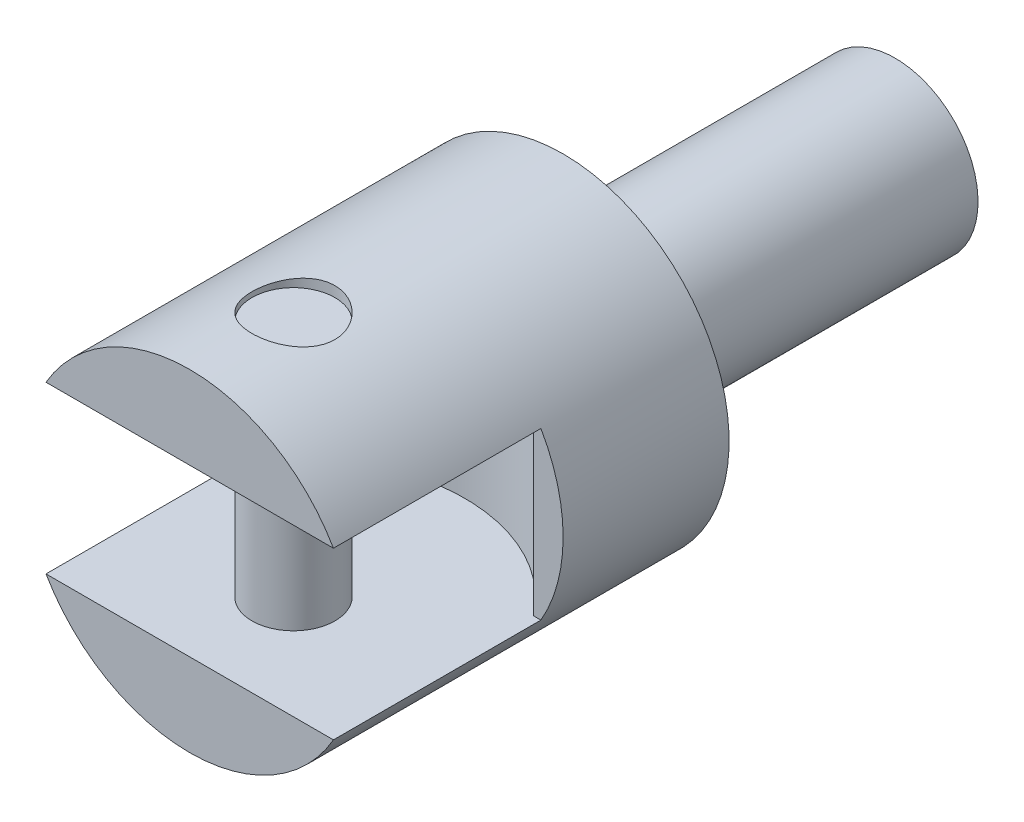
ISO-10303-21;
HEADER;
FILE_DESCRIPTION(('STEP AP214'),'2;1');
FILE_NAME('part.step','',(''),(''),'','','');
FILE_SCHEMA(('AUTOMOTIVE_DESIGN { 1 0 10303 214 1 1 1 1 }'));
ENDSEC;
DATA;
#1=APPLICATION_CONTEXT('core data for automotive mechanical design processes');
#2=APPLICATION_PROTOCOL_DEFINITION('international standard','automotive_design',2000,#1);
#3=PRODUCT_CONTEXT('',#1,'mechanical');
#4=PRODUCT('Part','Part','',(#3));
#5=PRODUCT_RELATED_PRODUCT_CATEGORY('part','',(#4));
#6=PRODUCT_DEFINITION_FORMATION('','',#4);
#7=PRODUCT_DEFINITION_CONTEXT('part definition',#1,'design');
#8=PRODUCT_DEFINITION('design','',#6,#7);
#9=PRODUCT_DEFINITION_SHAPE('','',#8);
#10=(LENGTH_UNIT() NAMED_UNIT(*) SI_UNIT(.MILLI.,.METRE.));
#11=(NAMED_UNIT(*) PLANE_ANGLE_UNIT() SI_UNIT($,.RADIAN.));
#12=(NAMED_UNIT(*) SI_UNIT($,.STERADIAN.) SOLID_ANGLE_UNIT());
#13=UNCERTAINTY_MEASURE_WITH_UNIT(LENGTH_MEASURE(1.E-05),#10,'distance_accuracy_value','');
#14=(GEOMETRIC_REPRESENTATION_CONTEXT(3) GLOBAL_UNCERTAINTY_ASSIGNED_CONTEXT((#13)) GLOBAL_UNIT_ASSIGNED_CONTEXT((#10,
#11,#12)) REPRESENTATION_CONTEXT('',''));
#15=CARTESIAN_POINT('',(0.,0.,0.));
#16=DIRECTION('',(0.,0.,1.));
#17=DIRECTION('',(1.,0.,0.));
#18=AXIS2_PLACEMENT_3D('',#15,#16,#17);
#19=CARTESIAN_POINT('',(0.,-14.,13.));
#20=DIRECTION('',(0.,1.,0.));
#21=DIRECTION('',(-1.,0.,0.));
#22=AXIS2_PLACEMENT_3D('',#19,#20,#21);
#23=CYLINDRICAL_SURFACE('',#22,2.);
#24=CARTESIAN_POINT('',(0.,-8.,15.));
#25=CARTESIAN_POINT('',(-0.110501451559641,-7.99999813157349,14.9999968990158));
#26=CARTESIAN_POINT('',(-0.22103754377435,-7.99768770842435,14.9908112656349));
#27=CARTESIAN_POINT('',(-0.438941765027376,-7.98869485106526,14.954366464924));
#28=CARTESIAN_POINT('',(-0.546308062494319,-7.98200993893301,14.9270970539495));
#29=CARTESIAN_POINT('',(-0.754694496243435,-7.96500835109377,14.8554143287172));
#30=CARTESIAN_POINT('',(-0.855722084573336,-7.95469603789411,14.811021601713));
#31=CARTESIAN_POINT('',(-1.04889617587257,-7.93153791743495,14.7064248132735));
#32=CARTESIAN_POINT('',(-1.14104237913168,-7.91869202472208,14.646220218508));
#33=CARTESIAN_POINT('',(-1.31573590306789,-7.89156551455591,14.5103989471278));
#34=CARTESIAN_POINT('',(-1.39807425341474,-7.87726276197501,14.4345179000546));
#35=CARTESIAN_POINT('',(-1.54899856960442,-7.84898160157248,14.270063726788));
#36=CARTESIAN_POINT('',(-1.61758298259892,-7.83500323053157,14.1814891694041));
#37=CARTESIAN_POINT('',(-1.74003539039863,-7.80873034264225,13.992539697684));
#38=CARTESIAN_POINT('',(-1.79366962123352,-7.79646392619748,13.8920090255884));
#39=CARTESIAN_POINT('',(-1.88319587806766,-7.77532659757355,13.6830021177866));
#40=CARTESIAN_POINT('',(-1.91909074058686,-7.76645514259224,13.5745271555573));
#41=CARTESIAN_POINT('',(-1.97140644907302,-7.7533396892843,13.3550086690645));
#42=CARTESIAN_POINT('',(-1.98820302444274,-7.74900654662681,13.244060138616));
#43=CARTESIAN_POINT('',(-2.00301570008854,-7.74519149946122,13.0208419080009));
#44=CARTESIAN_POINT('',(-2.00103485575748,-7.74570880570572,12.9085724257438));
#45=CARTESIAN_POINT('',(-1.9786486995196,-7.75145607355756,12.6887789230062));
#46=CARTESIAN_POINT('',(-1.95869112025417,-7.75657150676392,12.5812058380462));
#47=CARTESIAN_POINT('',(-1.90163224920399,-7.77075612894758,12.3709852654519));
#48=CARTESIAN_POINT('',(-1.86452973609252,-7.77982559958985,12.2683381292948));
#49=CARTESIAN_POINT('',(-1.77385263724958,-7.80100151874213,12.0696826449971));
#50=CARTESIAN_POINT('',(-1.72011555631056,-7.81313769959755,11.9737517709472));
#51=CARTESIAN_POINT('',(-1.59780836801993,-7.83906281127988,11.7921083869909));
#52=CARTESIAN_POINT('',(-1.52923566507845,-7.85285203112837,11.7063976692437));
#53=CARTESIAN_POINT('',(-1.37688456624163,-7.88101174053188,11.5450618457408));
#54=CARTESIAN_POINT('',(-1.29272834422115,-7.89538759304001,11.4697940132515));
#55=CARTESIAN_POINT('',(-1.11281589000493,-7.92274620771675,11.3343716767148));
#56=CARTESIAN_POINT('',(-1.01705930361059,-7.93572892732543,11.2742176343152));
#57=CARTESIAN_POINT('',(-0.816154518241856,-7.9589030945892,11.1705992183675));
#58=CARTESIAN_POINT('',(-0.710975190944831,-7.96908480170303,11.1271928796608));
#59=CARTESIAN_POINT('',(-0.49450134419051,-7.98543889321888,11.0587769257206));
#60=CARTESIAN_POINT('',(-0.383207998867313,-7.99161204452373,11.0337637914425));
#61=CARTESIAN_POINT('',(-0.160719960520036,-7.999139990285,11.0033899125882));
#62=CARTESIAN_POINT('',(-0.0495956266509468,-8.00061404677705,10.9975426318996));
#63=CARTESIAN_POINT('',(0.172043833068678,-7.99891739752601,11.0043320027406));
#64=CARTESIAN_POINT('',(0.282559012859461,-7.99574710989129,11.0169669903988));
#65=CARTESIAN_POINT('',(0.498152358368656,-7.98519441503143,11.0599612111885));
#66=CARTESIAN_POINT('',(0.603286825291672,-7.97787512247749,11.0900550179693));
#67=CARTESIAN_POINT('',(0.807009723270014,-7.95984942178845,11.1668094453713));
#68=CARTESIAN_POINT('',(0.905597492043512,-7.94914267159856,11.2134717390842));
#69=CARTESIAN_POINT('',(1.0953641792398,-7.92524410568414,11.3229815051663));
#70=CARTESIAN_POINT('',(1.18638058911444,-7.91201156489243,11.3861014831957));
#71=CARTESIAN_POINT('',(1.35670215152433,-7.88459345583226,11.5263865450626));
#72=CARTESIAN_POINT('',(1.43600527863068,-7.87040772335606,11.6035540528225));
#73=CARTESIAN_POINT('',(1.58265409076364,-7.84225275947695,11.7720026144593));
#74=CARTESIAN_POINT('',(1.64965849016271,-7.82829738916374,11.8635836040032));
#75=CARTESIAN_POINT('',(1.76734767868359,-7.80257171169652,12.0569768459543));
#76=CARTESIAN_POINT('',(1.81803319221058,-7.79080130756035,12.1587886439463));
#77=CARTESIAN_POINT('',(1.90126856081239,-7.77090792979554,12.3692076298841));
#78=CARTESIAN_POINT('',(1.93392586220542,-7.76276340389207,12.4777701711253));
#79=CARTESIAN_POINT('',(1.98046087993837,-7.75102325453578,12.6990795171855));
#80=CARTESIAN_POINT('',(1.99434270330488,-7.74742663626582,12.8118254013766));
#81=CARTESIAN_POINT('',(2.00271812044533,-7.74526534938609,13.0348280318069));
#82=CARTESIAN_POINT('',(1.99775719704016,-7.74655910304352,13.145063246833));
#83=CARTESIAN_POINT('',(1.96983637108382,-7.7537054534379,13.3630718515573));
#84=CARTESIAN_POINT('',(1.94687683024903,-7.75955795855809,13.4708452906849));
#85=CARTESIAN_POINT('',(1.88390842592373,-7.77508347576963,13.6802779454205));
#86=CARTESIAN_POINT('',(1.84400187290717,-7.78473353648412,13.7819697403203));
#87=CARTESIAN_POINT('',(1.74835321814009,-7.80677007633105,13.9772871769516));
#88=CARTESIAN_POINT('',(1.69260892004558,-7.81915693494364,14.0709116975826));
#89=CARTESIAN_POINT('',(1.56515699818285,-7.8456751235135,14.2500728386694));
#90=CARTESIAN_POINT('',(1.49307088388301,-7.85984353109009,14.3353347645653));
#91=CARTESIAN_POINT('',(1.33571916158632,-7.88810702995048,14.4927293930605));
#92=CARTESIAN_POINT('',(1.25045042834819,-7.90220210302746,14.5648589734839));
#93=CARTESIAN_POINT('',(1.06729011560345,-7.9290354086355,14.6952150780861));
#94=CARTESIAN_POINT('',(0.969197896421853,-7.94174444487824,14.7531661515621));
#95=CARTESIAN_POINT('',(0.764354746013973,-7.96406566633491,14.8516632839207));
#96=CARTESIAN_POINT('',(0.65761008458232,-7.97368006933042,14.892221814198));
#97=CARTESIAN_POINT('',(0.459213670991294,-7.98730746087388,14.9487624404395));
#98=CARTESIAN_POINT('',(0.368506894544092,-7.9920344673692,14.9679349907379));
#99=CARTESIAN_POINT('',(0.185208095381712,-7.99838140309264,14.9935545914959));
#100=CARTESIAN_POINT('',(0.0926162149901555,-8.00000156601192,15.0000025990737));
#101=CARTESIAN_POINT('',(0.,-8.,15.));
#102=B_SPLINE_CURVE_WITH_KNOTS('',3,(#24,#25,#26,#27,#28,#29,#30,#31,#32,#33,#34,#35,#36,#37,
#38,#39,#40,#41,#42,#43,#44,#45,#46,#47,#48,#49,#50,#51,#52,#53,#54,#55,#56,#57,#58,#59,#60,#61,
#62,#63,#64,#65,#66,#67,#68,#69,#70,#71,#72,#73,#74,#75,#76,#77,#78,#79,#80,#81,#82,#83,#84,#85,
#86,#87,#88,#89,#90,#91,#92,#93,#94,#95,#96,#97,#98,#99,#100,#101),.UNSPECIFIED.,.T.,.F.,(4,2,2,
2,2,2,2,2,2,2,2,2,2,2,2,2,2,2,2,2,2,2,2,2,2,2,2,2,2,2,2,2,2,2,2,2,2,2,4),(0.,0.331164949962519,
0.662517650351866,0.993473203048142,1.32443992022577,1.66152580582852,1.99864972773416,
2.34078196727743,2.68285948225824,3.01808393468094,3.35325384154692,3.68029996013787,
4.00736937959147,4.337740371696,4.66816921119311,5.00802001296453,5.34788119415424,
5.6889097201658,6.02987298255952,6.36211078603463,6.69431868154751,7.02160366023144,
7.34892169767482,7.68204783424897,8.01523150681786,8.35659345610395,8.69794025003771,
9.03723006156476,9.37644564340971,9.70591707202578,10.0353818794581,10.3628853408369,
10.6904342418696,11.0265276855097,11.3627009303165,11.7049624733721,12.0469781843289,
12.3245632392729,12.6021274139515),.UNSPECIFIED.);
#103=CARTESIAN_POINT('',(0.,-8.,15.));
#104=VERTEX_POINT('',#103);
#105=EDGE_CURVE('E110',#104,#104,#102,.T.);
#106=ORIENTED_EDGE('',*,*,#105,.T.);
#107=EDGE_LOOP('',(#106));
#108=FACE_BOUND('',#107,.T.);
#109=CARTESIAN_POINT('',(0.,-7.5,13.));
#110=DIRECTION('',(0.,1.,0.));
#111=DIRECTION('',(0.,0.,1.));
#112=AXIS2_PLACEMENT_3D('',#109,#110,#111);
#113=CIRCLE('',#112,2.);
#114=CARTESIAN_POINT('',(0.,-7.5,15.));
#115=VERTEX_POINT('',#114);
#116=EDGE_CURVE('E9',#115,#115,#113,.F.);
#117=ORIENTED_EDGE('',*,*,#116,.F.);
#118=EDGE_LOOP('',(#117));
#119=FACE_BOUND('',#118,.T.);
#120=ADVANCED_FACE('F14',(#108,#119),#23,.F.);
#121=CARTESIAN_POINT('',(-3.25,0.,0.));
#122=DIRECTION('',(0.,0.,-1.));
#123=DIRECTION('',(0.,-1.,0.));
#124=AXIS2_PLACEMENT_3D('',#121,#122,#123);
#125=PLANE('',#124);
#126=CARTESIAN_POINT('',(0.,0.,0.));
#127=DIRECTION('',(0.,0.,-1.));
#128=DIRECTION('',(0.,-1.,0.));
#129=AXIS2_PLACEMENT_3D('',#126,#127,#128);
#130=CIRCLE('',#129,3.25);
#131=CARTESIAN_POINT('',(0.,-3.25,0.));
#132=VERTEX_POINT('',#131);
#133=EDGE_CURVE('E170',#132,#132,#130,.T.);
#134=ORIENTED_EDGE('',*,*,#133,.F.);
#135=EDGE_LOOP('',(#134));
#136=FACE_BOUND('',#135,.T.);
#137=CARTESIAN_POINT('',(0.,0.,0.));
#138=DIRECTION('',(0.,0.,-1.));
#139=DIRECTION('',(0.,-1.,0.));
#140=AXIS2_PLACEMENT_3D('',#137,#138,#139);
#141=CIRCLE('',#140,8.);
#142=CARTESIAN_POINT('',(0.,-8.,0.));
#143=VERTEX_POINT('',#142);
#144=EDGE_CURVE('E91',#143,#143,#141,.T.);
#145=ORIENTED_EDGE('',*,*,#144,.T.);
#146=EDGE_LOOP('',(#145));
#147=FACE_BOUND('',#146,.T.);
#148=ADVANCED_FACE('F119',(#136,#147),#125,.T.);
#149=CARTESIAN_POINT('',(0.,0.,0.));
#150=DIRECTION('',(0.,0.,-1.));
#151=DIRECTION('',(0.,-1.,0.));
#152=AXIS2_PLACEMENT_3D('',#149,#150,#151);
#153=CYLINDRICAL_SURFACE('',#152,3.25);
#154=ORIENTED_EDGE('',*,*,#133,.T.);
#155=EDGE_LOOP('',(#154));
#156=FACE_BOUND('',#155,.T.);
#157=CARTESIAN_POINT('',(0.,0.,-2.));
#158=DIRECTION('',(0.,0.,-1.));
#159=DIRECTION('',(0.,-1.,0.));
#160=AXIS2_PLACEMENT_3D('',#157,#158,#159);
#161=CIRCLE('',#160,3.25);
#162=CARTESIAN_POINT('',(0.,-3.25,-2.));
#163=VERTEX_POINT('',#162);
#164=EDGE_CURVE('E336',#163,#163,#161,.T.);
#165=ORIENTED_EDGE('',*,*,#164,.F.);
#166=EDGE_LOOP('',(#165));
#167=FACE_BOUND('',#166,.T.);
#168=ADVANCED_FACE('F157',(#156,#167),#153,.T.);
#169=CARTESIAN_POINT('',(-4.,0.,-2.));
#170=DIRECTION('',(0.,0.,1.));
#171=DIRECTION('',(0.,1.,0.));
#172=AXIS2_PLACEMENT_3D('',#169,#170,#171);
#173=PLANE('',#172);
#174=ORIENTED_EDGE('',*,*,#164,.T.);
#175=EDGE_LOOP('',(#174));
#176=FACE_BOUND('',#175,.T.);
#177=CARTESIAN_POINT('',(0.,0.,-2.));
#178=DIRECTION('',(0.,0.,-1.));
#179=DIRECTION('',(0.,-1.,0.));
#180=AXIS2_PLACEMENT_3D('',#177,#178,#179);
#181=CIRCLE('',#180,4.);
#182=CARTESIAN_POINT('',(0.,-4.,-2.));
#183=VERTEX_POINT('',#182);
#184=EDGE_CURVE('E333',#183,#183,#181,.T.);
#185=ORIENTED_EDGE('',*,*,#184,.F.);
#186=EDGE_LOOP('',(#185));
#187=FACE_BOUND('',#186,.T.);
#188=ADVANCED_FACE('F153',(#176,#187),#173,.T.);
#189=CARTESIAN_POINT('',(0.,0.,0.));
#190=DIRECTION('',(0.,0.,-1.));
#191=DIRECTION('',(0.,-1.,0.));
#192=AXIS2_PLACEMENT_3D('',#189,#190,#191);
#193=CYLINDRICAL_SURFACE('',#192,4.);
#194=ORIENTED_EDGE('',*,*,#184,.T.);
#195=EDGE_LOOP('',(#194));
#196=FACE_BOUND('',#195,.T.);
#197=CARTESIAN_POINT('',(0.,0.,-16.));
#198=DIRECTION('',(0.,0.,-1.));
#199=DIRECTION('',(0.,-1.,0.));
#200=AXIS2_PLACEMENT_3D('',#197,#198,#199);
#201=CIRCLE('',#200,4.);
#202=CARTESIAN_POINT('',(0.,-4.,-16.));
#203=VERTEX_POINT('',#202);
#204=EDGE_CURVE('E84',#203,#203,#201,.T.);
#205=ORIENTED_EDGE('',*,*,#204,.F.);
#206=EDGE_LOOP('',(#205));
#207=FACE_BOUND('',#206,.T.);
#208=ADVANCED_FACE('F149',(#196,#207),#193,.T.);
#209=CARTESIAN_POINT('',(0.,0.,-16.));
#210=DIRECTION('',(0.,0.,-1.));
#211=DIRECTION('',(0.,-1.,0.));
#212=AXIS2_PLACEMENT_3D('',#209,#210,#211);
#213=PLANE('',#212);
#214=ORIENTED_EDGE('',*,*,#204,.T.);
#215=EDGE_LOOP('',(#214));
#216=FACE_BOUND('',#215,.T.);
#217=ADVANCED_FACE('F145',(#216),#213,.T.);
#218=CARTESIAN_POINT('',(0.,0.,18.));
#219=DIRECTION('',(0.,0.,1.));
#220=DIRECTION('',(0.,1.,0.));
#221=AXIS2_PLACEMENT_3D('',#218,#219,#220);
#222=PLANE('',#221);
#223=DIRECTION('',(1.,0.,0.));
#224=VECTOR('',#223,1.);
#225=CARTESIAN_POINT('',(-8.,4.,18.));
#226=LINE('',#225,#224);
#227=CARTESIAN_POINT('',(-6.92820323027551,4.,18.));
#228=VERTEX_POINT('',#227);
#229=CARTESIAN_POINT('',(6.92820323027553,4.,18.));
#230=VERTEX_POINT('',#229);
#231=EDGE_CURVE('E313',#228,#230,#226,.T.);
#232=ORIENTED_EDGE('',*,*,#231,.T.);
#233=CARTESIAN_POINT('',(0.,0.,18.));
#234=DIRECTION('',(0.,0.,1.));
#235=DIRECTION('',(0.,1.,0.));
#236=AXIS2_PLACEMENT_3D('',#233,#234,#235);
#237=CIRCLE('',#236,8.);
#238=EDGE_CURVE('E87',#230,#228,#237,.T.);
#239=ORIENTED_EDGE('',*,*,#238,.T.);
#240=EDGE_LOOP('',(#232,#239));
#241=FACE_BOUND('',#240,.T.);
#242=ADVANCED_FACE('F142',(#241),#222,.T.);
#243=DIRECTION('',(1.,0.,0.));
#244=VECTOR('',#243,1.);
#245=CARTESIAN_POINT('',(-8.,-4.,18.));
#246=LINE('',#245,#244);
#247=CARTESIAN_POINT('',(-6.92820323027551,-4.,18.));
#248=VERTEX_POINT('',#247);
#249=CARTESIAN_POINT('',(6.92820323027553,-4.,18.));
#250=VERTEX_POINT('',#249);
#251=EDGE_CURVE('E69',#248,#250,#246,.T.);
#252=ORIENTED_EDGE('',*,*,#251,.F.);
#253=CARTESIAN_POINT('',(0.,0.,18.));
#254=DIRECTION('',(0.,0.,1.));
#255=DIRECTION('',(0.,1.,0.));
#256=AXIS2_PLACEMENT_3D('',#253,#254,#255);
#257=CIRCLE('',#256,8.);
#258=EDGE_CURVE('E83',#248,#250,#257,.T.);
#259=ORIENTED_EDGE('',*,*,#258,.T.);
#260=EDGE_LOOP('',(#252,#259));
#261=FACE_BOUND('',#260,.T.);
#262=ADVANCED_FACE('F86',(#261),#222,.T.);
#263=CARTESIAN_POINT('',(0.,-4.,13.));
#264=DIRECTION('',(0.,1.,0.));
#265=DIRECTION('',(-1.,0.,0.));
#266=AXIS2_PLACEMENT_3D('',#263,#264,#265);
#267=CYLINDRICAL_SURFACE('',#266,8.25);
#268=CARTESIAN_POINT('',(0.,4.,13.));
#269=DIRECTION('',(0.,1.,0.));
#270=DIRECTION('',(-1.,0.,0.));
#271=AXIS2_PLACEMENT_3D('',#268,#269,#270);
#272=CIRCLE('',#271,8.25);
#273=CARTESIAN_POINT('',(6.56220237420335,4.,8.));
#274=VERTEX_POINT('',#273);
#275=CARTESIAN_POINT('',(-6.56220237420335,4.,8.));
#276=VERTEX_POINT('',#275);
#277=EDGE_CURVE('E307',#274,#276,#272,.T.);
#278=ORIENTED_EDGE('',*,*,#277,.T.);
#279=DIRECTION('',(0.,1.,0.));
#280=VECTOR('',#279,1.);
#281=CARTESIAN_POINT('',(-6.56220237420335,-4.,8.));
#282=LINE('',#281,#280);
#283=CARTESIAN_POINT('',(-6.56220237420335,-4.,8.));
#284=VERTEX_POINT('',#283);
#285=EDGE_CURVE('E324',#284,#276,#282,.T.);
#286=ORIENTED_EDGE('',*,*,#285,.F.);
#287=CARTESIAN_POINT('',(0.,-4.,13.));
#288=DIRECTION('',(0.,1.,0.));
#289=DIRECTION('',(-1.,0.,0.));
#290=AXIS2_PLACEMENT_3D('',#287,#288,#289);
#291=CIRCLE('',#290,8.25);
#292=CARTESIAN_POINT('',(6.56220237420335,-4.,8.));
#293=VERTEX_POINT('',#292);
#294=EDGE_CURVE('E320',#293,#284,#291,.T.);
#295=ORIENTED_EDGE('',*,*,#294,.F.);
#296=DIRECTION('',(0.,1.,0.));
#297=VECTOR('',#296,1.);
#298=CARTESIAN_POINT('',(6.56220237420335,-4.,8.));
#299=LINE('',#298,#297);
#300=EDGE_CURVE('E321',#293,#274,#299,.T.);
#301=ORIENTED_EDGE('',*,*,#300,.T.);
#302=EDGE_LOOP('',(#278,#286,#295,#301));
#303=FACE_BOUND('',#302,.T.);
#304=ADVANCED_FACE('F138',(#303),#267,.F.);
#305=CARTESIAN_POINT('',(0.,7.5,13.));
#306=DIRECTION('',(0.,1.,0.));
#307=DIRECTION('',(0.911552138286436,0.,-0.411184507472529));
#308=AXIS2_PLACEMENT_3D('',#305,#306,#307);
#309=CIRCLE('',#308,2.);
#310=CARTESIAN_POINT('',(1.82310427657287,7.5,12.1776309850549));
#311=VERTEX_POINT('',#310);
#312=EDGE_CURVE('E94',#311,#311,#309,.T.);
#313=ORIENTED_EDGE('',*,*,#312,.F.);
#314=EDGE_LOOP('',(#313));
#315=FACE_BOUND('',#314,.T.);
#316=CARTESIAN_POINT('',(-2.,7.74596669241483,13.));
#317=CARTESIAN_POINT('',(-1.99999686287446,7.74596880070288,13.1104406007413));
#318=CARTESIAN_POINT('',(-1.99082099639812,7.74835444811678,13.2209159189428));
#319=CARTESIAN_POINT('',(-1.95441850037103,7.75761489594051,13.4386940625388));
#320=CARTESIAN_POINT('',(-1.92718136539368,7.76449230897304,13.5459950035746));
#321=CARTESIAN_POINT('',(-1.85559295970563,7.7819097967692,13.7542428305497));
#322=CARTESIAN_POINT('',(-1.81126378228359,7.79244514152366,13.8551977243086));
#323=CARTESIAN_POINT('',(-1.70681691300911,7.81598553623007,14.0482486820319));
#324=CARTESIAN_POINT('',(-1.64669855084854,7.82899069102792,14.1403443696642));
#325=CARTESIAN_POINT('',(-1.5109667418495,7.856325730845,14.3150893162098));
#326=CARTESIAN_POINT('',(-1.43506951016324,7.87067678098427,14.39751488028));
#327=CARTESIAN_POINT('',(-1.27054565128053,7.89890300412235,14.5486091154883));
#328=CARTESIAN_POINT('',(-1.18191783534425,7.91277813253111,14.6172765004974));
#329=CARTESIAN_POINT('',(-0.992916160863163,7.93872332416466,14.739820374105));
#330=CARTESIAN_POINT('',(-0.892395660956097,7.95076549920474,14.7934771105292));
#331=CARTESIAN_POINT('',(-0.68341054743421,7.97144649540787,14.8830477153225));
#332=CARTESIAN_POINT('',(-0.574947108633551,7.98008581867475,14.9189642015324));
#333=CARTESIAN_POINT('',(-0.355487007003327,7.99283807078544,14.9713182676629));
#334=CARTESIAN_POINT('',(-0.244586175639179,7.99703915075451,14.9881357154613));
#335=CARTESIAN_POINT('',(-0.0214630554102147,8.00074875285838,15.0030067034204));
#336=CARTESIAN_POINT('',(0.0907590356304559,8.00025796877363,15.0010630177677));
#337=CARTESIAN_POINT('',(0.310704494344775,7.99470475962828,14.9787401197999));
#338=CARTESIAN_POINT('',(0.418472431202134,7.98974401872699,14.9587709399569));
#339=CARTESIAN_POINT('',(0.629076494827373,7.97592669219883,14.9016229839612));
#340=CARTESIAN_POINT('',(0.731912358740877,7.96706989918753,14.8644432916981));
#341=CARTESIAN_POINT('',(0.930813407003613,7.94630007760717,14.7735979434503));
#342=CARTESIAN_POINT('',(1.02680901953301,7.93436015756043,14.7197863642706));
#343=CARTESIAN_POINT('',(1.20855124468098,7.90871923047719,14.597315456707));
#344=CARTESIAN_POINT('',(1.29429607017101,7.89501791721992,14.5286535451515));
#345=CARTESIAN_POINT('',(1.45554807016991,7.86690971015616,14.3762330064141));
#346=CARTESIAN_POINT('',(1.5307153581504,7.85249375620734,14.2921160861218));
#347=CARTESIAN_POINT('',(1.66595275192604,7.82492034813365,14.1123200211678));
#348=CARTESIAN_POINT('',(1.72602215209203,7.81176295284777,14.0166403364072));
#349=CARTESIAN_POINT('',(1.82957625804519,7.78816397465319,13.8157679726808));
#350=CARTESIAN_POINT('',(1.87297913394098,7.77773586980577,13.7105314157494));
#351=CARTESIAN_POINT('',(1.94137124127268,7.76094912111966,13.4939316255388));
#352=CARTESIAN_POINT('',(1.96636441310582,7.75458960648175,13.3825697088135));
#353=CARTESIAN_POINT('',(1.99666371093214,7.74684284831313,13.1600323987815));
#354=CARTESIAN_POINT('',(2.0024723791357,7.74532871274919,13.0489297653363));
#355=CARTESIAN_POINT('',(1.99561359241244,7.74709874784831,12.8273424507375));
#356=CARTESIAN_POINT('',(1.98294783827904,7.75038247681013,12.716857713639));
#357=CARTESIAN_POINT('',(1.93994037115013,7.76125665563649,12.5015085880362));
#358=CARTESIAN_POINT('',(1.90989125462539,7.768775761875,12.3965818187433));
#359=CARTESIAN_POINT('',(1.83329446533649,7.7872057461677,12.1932548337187));
#360=CARTESIAN_POINT('',(1.78674483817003,7.7981170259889,12.0948553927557));
#361=CARTESIAN_POINT('',(1.67741653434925,7.8223690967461,11.9052469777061));
#362=CARTESIAN_POINT('',(1.61433740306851,7.83575334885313,11.8142169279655));
#363=CARTESIAN_POINT('',(1.47412058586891,7.86333666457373,11.6438493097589));
#364=CARTESIAN_POINT('',(1.39698058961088,7.87753586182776,11.56451366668));
#365=CARTESIAN_POINT('',(1.22852544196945,7.90557922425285,11.4177511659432));
#366=CARTESIAN_POINT('',(1.13690390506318,7.91940561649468,11.350671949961));
#367=CARTESIAN_POINT('',(0.943405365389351,7.94477773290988,11.232851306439));
#368=CARTESIAN_POINT('',(0.841528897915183,7.95632357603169,11.1821090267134));
#369=CARTESIAN_POINT('',(0.631116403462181,7.97576092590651,11.0988431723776));
#370=CARTESIAN_POINT('',(0.522634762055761,7.98367864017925,11.0661885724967));
#371=CARTESIAN_POINT('',(0.30149952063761,7.99508234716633,11.0196317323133));
#372=CARTESIAN_POINT('',(0.188846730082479,7.99856919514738,11.0057258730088));
#373=CARTESIAN_POINT('',(-0.0341670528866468,8.00068338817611,10.9972648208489));
#374=CARTESIAN_POINT('',(-0.144507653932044,7.99943957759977,11.0021965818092));
#375=CARTESIAN_POINT('',(-0.362734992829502,7.99251792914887,11.0300956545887));
#376=CARTESIAN_POINT('',(-0.470621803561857,7.98684022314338,11.0530624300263));
#377=CARTESIAN_POINT('',(-0.680342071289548,7.97170865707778,11.1161044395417));
#378=CARTESIAN_POINT('',(-0.782204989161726,7.96227529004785,11.1560869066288));
#379=CARTESIAN_POINT('',(-0.977834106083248,7.94062577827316,11.2519411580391));
#380=CARTESIAN_POINT('',(-1.07159928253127,7.92840928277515,11.307814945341));
#381=CARTESIAN_POINT('',(-1.25080385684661,7.90214499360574,11.4354304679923));
#382=CARTESIAN_POINT('',(-1.33598997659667,7.88806033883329,11.5075202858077));
#383=CARTESIAN_POINT('',(-1.49323004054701,7.85981298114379,11.6648457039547));
#384=CARTESIAN_POINT('',(-1.56528065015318,7.84565025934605,11.7500846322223));
#385=CARTESIAN_POINT('',(-1.69552405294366,7.81854951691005,11.9332028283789));
#386=CARTESIAN_POINT('',(-1.75343323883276,7.80563927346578,12.0312882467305));
#387=CARTESIAN_POINT('',(-1.85185379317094,7.78287910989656,12.2361109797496));
#388=CARTESIAN_POINT('',(-1.89237781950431,7.77302696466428,12.3428419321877));
#389=CARTESIAN_POINT('',(-1.94884505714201,7.75903817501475,12.5411540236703));
#390=CARTESIAN_POINT('',(-1.96798634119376,7.75417326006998,12.6317863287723));
#391=CARTESIAN_POINT('',(-1.99356458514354,7.7476367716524,12.8149377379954));
#392=CARTESIAN_POINT('',(-2.0000026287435,7.74596492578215,12.9074566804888));
#393=CARTESIAN_POINT('',(-2.,7.74596669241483,13.));
#394=B_SPLINE_CURVE_WITH_KNOTS('',3,(#316,#317,#318,#319,#320,#321,#322,#323,#324,#325,#326,
#327,#328,#329,#330,#331,#332,#333,#334,#335,#336,#337,#338,#339,#340,#341,#342,#343,#344,#345,
#346,#347,#348,#349,#350,#351,#352,#353,#354,#355,#356,#357,#358,#359,#360,#361,#362,#363,#364,
#365,#366,#367,#368,#369,#370,#371,#372,#373,#374,#375,#376,#377,#378,#379,#380,#381,#382,#383,
#384,#385,#386,#387,#388,#389,#390,#391,#392,#393),.UNSPECIFIED.,.T.,.F.,(4,2,2,2,2,2,2,2,2,2,2,
2,2,2,2,2,2,2,2,2,2,2,2,2,2,2,2,2,2,2,2,2,2,2,2,2,2,2,4),(0.,0.330981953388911,
0.662156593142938,0.992904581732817,1.32366661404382,1.66099163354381,1.99834817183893,
2.34041197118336,2.68242527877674,3.01751000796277,3.35254518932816,3.68014610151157,
4.00776445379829,4.33834299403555,4.6689790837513,5.0085637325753,5.34816424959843,
5.68941145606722,6.03058560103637,6.36274859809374,6.69488101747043,7.02157924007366,
7.34831617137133,7.68146276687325,8.01466415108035,8.35620264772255,8.69772332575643,
9.03673658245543,9.3756843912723,9.70546756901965,10.0352409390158,10.3632390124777,
10.6912784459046,11.0271767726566,11.3631602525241,11.7054118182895,12.0474137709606,
12.3247826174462,12.6021278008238),.UNSPECIFIED.);
#395=CARTESIAN_POINT('',(-2.,7.74596669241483,13.));
#396=VERTEX_POINT('',#395);
#397=EDGE_CURVE('E103',#396,#396,#394,.T.);
#398=ORIENTED_EDGE('',*,*,#397,.T.);
#399=EDGE_LOOP('',(#398));
#400=FACE_BOUND('',#399,.T.);
#401=ADVANCED_FACE('F121',(#315,#400),#23,.F.);
#402=CARTESIAN_POINT('',(6.56220237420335,-4.,8.));
#403=DIRECTION('',(0.,0.,-1.));
#404=DIRECTION('',(-1.,0.,0.));
#405=AXIS2_PLACEMENT_3D('',#402,#403,#404);
#406=PLANE('',#405);
#407=DIRECTION('',(-1.,0.,0.));
#408=VECTOR('',#407,1.);
#409=CARTESIAN_POINT('',(6.56220237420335,-4.,8.));
#410=LINE('',#409,#408);
#411=CARTESIAN_POINT('',(6.92820323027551,-4.,8.));
#412=VERTEX_POINT('',#411);
#413=EDGE_CURVE('E79',#412,#293,#410,.T.);
#414=ORIENTED_EDGE('',*,*,#413,.F.);
#415=CARTESIAN_POINT('',(0.,0.,8.));
#416=DIRECTION('',(0.,0.,-1.));
#417=DIRECTION('',(-1.,0.,0.));
#418=AXIS2_PLACEMENT_3D('',#415,#416,#417);
#419=CIRCLE('',#418,8.);
#420=CARTESIAN_POINT('',(6.92820323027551,4.,8.));
#421=VERTEX_POINT('',#420);
#422=EDGE_CURVE('E23',#412,#421,#419,.F.);
#423=ORIENTED_EDGE('',*,*,#422,.T.);
#424=DIRECTION('',(-1.,0.,0.));
#425=VECTOR('',#424,1.);
#426=CARTESIAN_POINT('',(6.56220237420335,4.,8.));
#427=LINE('',#426,#425);
#428=EDGE_CURVE('E318',#421,#274,#427,.T.);
#429=ORIENTED_EDGE('',*,*,#428,.T.);
#430=ORIENTED_EDGE('',*,*,#300,.F.);
#431=EDGE_LOOP('',(#414,#423,#429,#430));
#432=FACE_BOUND('',#431,.T.);
#433=ADVANCED_FACE('F131',(#432),#406,.F.);
#434=CARTESIAN_POINT('',(0.,4.,13.));
#435=DIRECTION('',(0.,1.,0.));
#436=DIRECTION('',(-1.,0.,0.));
#437=AXIS2_PLACEMENT_3D('',#434,#435,#436);
#438=PLANE('',#437);
#439=ORIENTED_EDGE('',*,*,#231,.F.);
#440=DIRECTION('',(0.,0.,-1.));
#441=VECTOR('',#440,1.);
#442=CARTESIAN_POINT('',(-6.92820323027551,4.,0.));
#443=LINE('',#442,#441);
#444=CARTESIAN_POINT('',(-6.92820323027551,4.,8.));
#445=VERTEX_POINT('',#444);
#446=EDGE_CURVE('E323',#228,#445,#443,.T.);
#447=ORIENTED_EDGE('',*,*,#446,.T.);
#448=DIRECTION('',(-1.,0.,0.));
#449=VECTOR('',#448,1.);
#450=CARTESIAN_POINT('',(-6.56220237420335,4.,8.));
#451=LINE('',#450,#449);
#452=EDGE_CURVE('E309',#276,#445,#451,.T.);
#453=ORIENTED_EDGE('',*,*,#452,.F.);
#454=ORIENTED_EDGE('',*,*,#277,.F.);
#455=ORIENTED_EDGE('',*,*,#428,.F.);
#456=DIRECTION('',(0.,0.,-1.));
#457=VECTOR('',#456,1.);
#458=CARTESIAN_POINT('',(6.92820323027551,4.,0.));
#459=LINE('',#458,#457);
#460=EDGE_CURVE('E327',#421,#230,#459,.F.);
#461=ORIENTED_EDGE('',*,*,#460,.T.);
#462=EDGE_LOOP('',(#439,#447,#453,#454,#455,#461));
#463=FACE_BOUND('',#462,.T.);
#464=CARTESIAN_POINT('',(0.,4.,13.));
#465=DIRECTION('',(0.,1.,0.));
#466=DIRECTION('',(0.,0.,1.));
#467=AXIS2_PLACEMENT_3D('',#464,#465,#466);
#468=CIRCLE('',#467,2.);
#469=CARTESIAN_POINT('',(0.,4.,15.));
#470=VERTEX_POINT('',#469);
#471=EDGE_CURVE('E88',#470,#470,#468,.F.);
#472=ORIENTED_EDGE('',*,*,#471,.F.);
#473=EDGE_LOOP('',(#472));
#474=FACE_BOUND('',#473,.T.);
#475=ADVANCED_FACE('F128',(#463,#474),#438,.F.);
#476=CARTESIAN_POINT('',(-6.56220237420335,-4.,8.));
#477=DIRECTION('',(0.,0.,-1.));
#478=DIRECTION('',(0.,-1.,0.));
#479=AXIS2_PLACEMENT_3D('',#476,#477,#478);
#480=PLANE('',#479);
#481=CARTESIAN_POINT('',(0.,0.,8.));
#482=DIRECTION('',(0.,0.,-1.));
#483=DIRECTION('',(0.,-1.,0.));
#484=AXIS2_PLACEMENT_3D('',#481,#482,#483);
#485=CIRCLE('',#484,8.);
#486=CARTESIAN_POINT('',(-6.92820323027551,-4.,8.));
#487=VERTEX_POINT('',#486);
#488=EDGE_CURVE('E30',#445,#487,#485,.F.);
#489=ORIENTED_EDGE('',*,*,#488,.T.);
#490=DIRECTION('',(-1.,0.,0.));
#491=VECTOR('',#490,1.);
#492=CARTESIAN_POINT('',(-6.56220237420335,-4.,8.));
#493=LINE('',#492,#491);
#494=EDGE_CURVE('E80',#284,#487,#493,.T.);
#495=ORIENTED_EDGE('',*,*,#494,.F.);
#496=ORIENTED_EDGE('',*,*,#285,.T.);
#497=ORIENTED_EDGE('',*,*,#452,.T.);
#498=EDGE_LOOP('',(#489,#495,#496,#497));
#499=FACE_BOUND('',#498,.T.);
#500=ADVANCED_FACE('F127',(#499),#480,.F.);
#501=CARTESIAN_POINT('',(0.,-4.,13.));
#502=DIRECTION('',(0.,1.,0.));
#503=DIRECTION('',(-1.,0.,0.));
#504=AXIS2_PLACEMENT_3D('',#501,#502,#503);
#505=PLANE('',#504);
#506=ORIENTED_EDGE('',*,*,#251,.T.);
#507=DIRECTION('',(0.,0.,-1.));
#508=VECTOR('',#507,1.);
#509=CARTESIAN_POINT('',(6.92820323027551,-4.,0.));
#510=LINE('',#509,#508);
#511=EDGE_CURVE('E72',#412,#250,#510,.F.);
#512=ORIENTED_EDGE('',*,*,#511,.F.);
#513=ORIENTED_EDGE('',*,*,#413,.T.);
#514=ORIENTED_EDGE('',*,*,#294,.T.);
#515=ORIENTED_EDGE('',*,*,#494,.T.);
#516=DIRECTION('',(0.,0.,-1.));
#517=VECTOR('',#516,1.);
#518=CARTESIAN_POINT('',(-6.92820323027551,-4.,0.));
#519=LINE('',#518,#517);
#520=EDGE_CURVE('E75',#248,#487,#519,.T.);
#521=ORIENTED_EDGE('',*,*,#520,.F.);
#522=EDGE_LOOP('',(#506,#512,#513,#514,#515,#521));
#523=FACE_BOUND('',#522,.T.);
#524=CARTESIAN_POINT('',(0.,-4.,13.));
#525=DIRECTION('',(0.,1.,0.));
#526=DIRECTION('',(-1.,0.,0.));
#527=AXIS2_PLACEMENT_3D('',#524,#525,#526);
#528=CIRCLE('',#527,2.);
#529=CARTESIAN_POINT('',(-2.,-4.,13.));
#530=VERTEX_POINT('',#529);
#531=EDGE_CURVE('E100',#530,#530,#528,.T.);
#532=ORIENTED_EDGE('',*,*,#531,.F.);
#533=EDGE_LOOP('',(#532));
#534=FACE_BOUND('',#533,.T.);
#535=ADVANCED_FACE('F70',(#523,#534),#505,.T.);
#536=CARTESIAN_POINT('',(0.,0.,0.));
#537=DIRECTION('',(0.,0.,-1.));
#538=DIRECTION('',(0.,-1.,0.));
#539=AXIS2_PLACEMENT_3D('',#536,#537,#538);
#540=CYLINDRICAL_SURFACE('',#539,8.);
#541=ORIENTED_EDGE('',*,*,#105,.F.);
#542=EDGE_LOOP('',(#541));
#543=FACE_BOUND('',#542,.T.);
#544=ORIENTED_EDGE('',*,*,#397,.F.);
#545=EDGE_LOOP('',(#544));
#546=FACE_BOUND('',#545,.T.);
#547=ORIENTED_EDGE('',*,*,#520,.T.);
#548=ORIENTED_EDGE('',*,*,#488,.F.);
#549=ORIENTED_EDGE('',*,*,#446,.F.);
#550=ORIENTED_EDGE('',*,*,#238,.F.);
#551=ORIENTED_EDGE('',*,*,#460,.F.);
#552=ORIENTED_EDGE('',*,*,#422,.F.);
#553=ORIENTED_EDGE('',*,*,#511,.T.);
#554=ORIENTED_EDGE('',*,*,#258,.F.);
#555=EDGE_LOOP('',(#547,#548,#549,#550,#551,#552,#553,#554));
#556=FACE_BOUND('',#555,.T.);
#557=ORIENTED_EDGE('',*,*,#144,.F.);
#558=EDGE_LOOP('',(#557));
#559=FACE_BOUND('',#558,.T.);
#560=ADVANCED_FACE('F16',(#543,#546,#556,#559),#540,.T.);
#561=CARTESIAN_POINT('',(0.,7.5,13.));
#562=DIRECTION('',(0.,-1.,0.));
#563=DIRECTION('',(-0.911552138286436,0.,0.411184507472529));
#564=AXIS2_PLACEMENT_3D('',#561,#562,#563);
#565=CYLINDRICAL_SURFACE('',#564,2.);
#566=ORIENTED_EDGE('',*,*,#531,.T.);
#567=EDGE_LOOP('',(#566));
#568=FACE_BOUND('',#567,.T.);
#569=ORIENTED_EDGE('',*,*,#471,.T.);
#570=EDGE_LOOP('',(#569));
#571=FACE_BOUND('',#570,.T.);
#572=ADVANCED_FACE('F122',(#568,#571),#565,.T.);
#573=CARTESIAN_POINT('',(0.,7.5,13.));
#574=DIRECTION('',(0.,1.,0.));
#575=DIRECTION('',(0.911552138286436,0.,-0.411184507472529));
#576=AXIS2_PLACEMENT_3D('',#573,#574,#575);
#577=PLANE('',#576);
#578=ORIENTED_EDGE('',*,*,#312,.T.);
#579=EDGE_LOOP('',(#578));
#580=FACE_BOUND('',#579,.T.);
#581=ADVANCED_FACE('F178',(#580),#577,.T.);
#582=CARTESIAN_POINT('',(0.,-7.5,13.));
#583=DIRECTION('',(0.,1.,0.));
#584=DIRECTION('',(0.911552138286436,0.,-0.411184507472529));
#585=AXIS2_PLACEMENT_3D('',#582,#583,#584);
#586=PLANE('',#585);
#587=ORIENTED_EDGE('',*,*,#116,.T.);
#588=EDGE_LOOP('',(#587));
#589=FACE_BOUND('',#588,.T.);
#590=ADVANCED_FACE('F194',(#589),#586,.F.);
#591=CLOSED_SHELL('',(#120,#148,#168,#188,#208,#217,#242,#262,#304,#401,#433,#475,#500,#535,
#560,#572,#581,#590));
#592=MANIFOLD_SOLID_BREP('B1',#591);
#593=ADVANCED_BREP_SHAPE_REPRESENTATION('',(#18,#592),#14);
#594=SHAPE_DEFINITION_REPRESENTATION(#9,#593);
ENDSEC;
END-ISO-10303-21;
